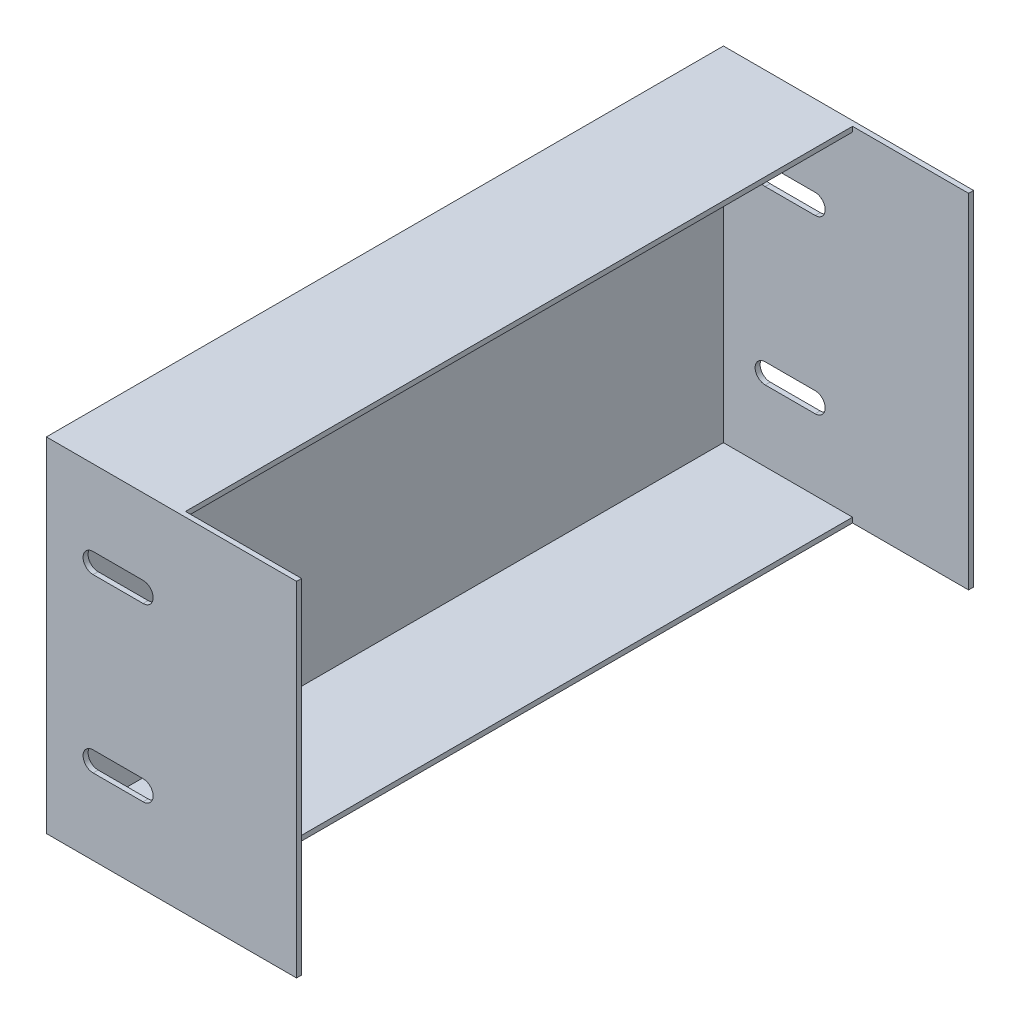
ISO-10303-21;
HEADER;
FILE_DESCRIPTION(('STEP AP214'),'2;1');
FILE_NAME('part.step','',(''),(''),'','','');
FILE_SCHEMA(('AUTOMOTIVE_DESIGN { 1 0 10303 214 1 1 1 1 }'));
ENDSEC;
DATA;
#1=APPLICATION_CONTEXT('core data for automotive mechanical design processes');
#2=APPLICATION_PROTOCOL_DEFINITION('international standard','automotive_design',2000,#1);
#3=PRODUCT_CONTEXT('',#1,'mechanical');
#4=PRODUCT('Part','Part','',(#3));
#5=PRODUCT_RELATED_PRODUCT_CATEGORY('part','',(#4));
#6=PRODUCT_DEFINITION_FORMATION('','',#4);
#7=PRODUCT_DEFINITION_CONTEXT('part definition',#1,'design');
#8=PRODUCT_DEFINITION('design','',#6,#7);
#9=PRODUCT_DEFINITION_SHAPE('','',#8);
#10=(LENGTH_UNIT() NAMED_UNIT(*) SI_UNIT(.MILLI.,.METRE.));
#11=(NAMED_UNIT(*) PLANE_ANGLE_UNIT() SI_UNIT($,.RADIAN.));
#12=(NAMED_UNIT(*) SI_UNIT($,.STERADIAN.) SOLID_ANGLE_UNIT());
#13=UNCERTAINTY_MEASURE_WITH_UNIT(LENGTH_MEASURE(1.E-05),#10,'distance_accuracy_value','');
#14=(GEOMETRIC_REPRESENTATION_CONTEXT(3) GLOBAL_UNCERTAINTY_ASSIGNED_CONTEXT((#13)) GLOBAL_UNIT_ASSIGNED_CONTEXT((#10,
#11,#12)) REPRESENTATION_CONTEXT('',''));
#15=CARTESIAN_POINT('',(0.,0.,0.));
#16=DIRECTION('',(0.,0.,1.));
#17=DIRECTION('',(1.,0.,0.));
#18=AXIS2_PLACEMENT_3D('',#15,#16,#17);
#19=CARTESIAN_POINT('',(75.,0.,0.));
#20=DIRECTION('',(1.,0.,0.));
#21=DIRECTION('',(0.,0.,-1.));
#22=AXIS2_PLACEMENT_3D('',#19,#20,#21);
#23=PLANE('',#22);
#24=DIRECTION('',(0.,1.,0.));
#25=VECTOR('',#24,1.);
#26=CARTESIAN_POINT('',(75.,-50.,-100.));
#27=LINE('',#26,#25);
#28=CARTESIAN_POINT('',(75.,-51.5,-100.));
#29=VERTEX_POINT('',#28);
#30=CARTESIAN_POINT('',(75.,51.5,-100.));
#31=VERTEX_POINT('',#30);
#32=EDGE_CURVE('E241',#29,#31,#27,.T.);
#33=ORIENTED_EDGE('',*,*,#32,.F.);
#34=DIRECTION('',(0.,0.,-1.));
#35=VECTOR('',#34,1.);
#36=CARTESIAN_POINT('',(75.,-51.5,-100.));
#37=LINE('',#36,#35);
#38=CARTESIAN_POINT('',(75.,-51.5,-101.5));
#39=VERTEX_POINT('',#38);
#40=EDGE_CURVE('E245',#29,#39,#37,.T.);
#41=ORIENTED_EDGE('',*,*,#40,.T.);
#42=DIRECTION('',(0.,1.,0.));
#43=VECTOR('',#42,1.);
#44=CARTESIAN_POINT('',(75.,-50.,-101.5));
#45=LINE('',#44,#43);
#46=CARTESIAN_POINT('',(75.,51.5,-101.5));
#47=VERTEX_POINT('',#46);
#48=EDGE_CURVE('E287',#39,#47,#45,.T.);
#49=ORIENTED_EDGE('',*,*,#48,.T.);
#50=DIRECTION('',(0.,0.,1.));
#51=VECTOR('',#50,1.);
#52=CARTESIAN_POINT('',(75.,51.5,-100.));
#53=LINE('',#52,#51);
#54=EDGE_CURVE('E247',#47,#31,#53,.T.);
#55=ORIENTED_EDGE('',*,*,#54,.T.);
#56=EDGE_LOOP('',(#33,#41,#49,#55));
#57=FACE_BOUND('',#56,.T.);
#58=ADVANCED_FACE('F56',(#57),#23,.T.);
#59=CARTESIAN_POINT('',(75.,-50.,-100.));
#60=DIRECTION('',(0.,0.,1.));
#61=DIRECTION('',(1.,0.,0.));
#62=AXIS2_PLACEMENT_3D('',#59,#60,#61);
#63=PLANE('',#62);
#64=DIRECTION('',(-1.,0.,0.));
#65=VECTOR('',#64,1.);
#66=CARTESIAN_POINT('',(75.,-50.,-100.));
#67=LINE('',#66,#65);
#68=CARTESIAN_POINT('',(40.2005511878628,-50.,-100.));
#69=VERTEX_POINT('',#68);
#70=CARTESIAN_POINT('',(1.5,-50.,-100.));
#71=VERTEX_POINT('',#70);
#72=EDGE_CURVE('E320',#69,#71,#67,.T.);
#73=ORIENTED_EDGE('',*,*,#72,.F.);
#74=DIRECTION('',(0.,-1.,0.));
#75=VECTOR('',#74,1.);
#76=CARTESIAN_POINT('',(40.2005511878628,51.5,-100.));
#77=LINE('',#76,#75);
#78=CARTESIAN_POINT('',(40.2005511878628,-51.5,-100.));
#79=VERTEX_POINT('',#78);
#80=EDGE_CURVE('E258',#69,#79,#77,.T.);
#81=ORIENTED_EDGE('',*,*,#80,.T.);
#82=DIRECTION('',(1.,0.,0.));
#83=VECTOR('',#82,1.);
#84=CARTESIAN_POINT('',(75.,-51.5,-100.));
#85=LINE('',#84,#83);
#86=EDGE_CURVE('E254',#79,#29,#85,.T.);
#87=ORIENTED_EDGE('',*,*,#86,.T.);
#88=ORIENTED_EDGE('',*,*,#32,.T.);
#89=DIRECTION('',(1.,0.,0.));
#90=VECTOR('',#89,1.);
#91=CARTESIAN_POINT('',(75.,51.5,-100.));
#92=LINE('',#91,#90);
#93=CARTESIAN_POINT('',(40.2005511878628,51.5,-100.));
#94=VERTEX_POINT('',#93);
#95=EDGE_CURVE('E455',#94,#31,#92,.T.);
#96=ORIENTED_EDGE('',*,*,#95,.F.);
#97=CARTESIAN_POINT('',(40.2005511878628,50.,-100.));
#98=VERTEX_POINT('',#97);
#99=EDGE_CURVE('E447',#94,#98,#77,.T.);
#100=ORIENTED_EDGE('',*,*,#99,.T.);
#101=DIRECTION('',(-1.,0.,0.));
#102=VECTOR('',#101,1.);
#103=CARTESIAN_POINT('',(75.,50.,-100.));
#104=LINE('',#103,#102);
#105=CARTESIAN_POINT('',(1.5,50.,-100.));
#106=VERTEX_POINT('',#105);
#107=EDGE_CURVE('E279',#98,#106,#104,.T.);
#108=ORIENTED_EDGE('',*,*,#107,.T.);
#109=DIRECTION('',(0.,-1.,0.));
#110=VECTOR('',#109,1.);
#111=CARTESIAN_POINT('',(1.5,-50.,-100.));
#112=LINE('',#111,#110);
#113=EDGE_CURVE('E251',#106,#71,#112,.T.);
#114=ORIENTED_EDGE('',*,*,#113,.T.);
#115=EDGE_LOOP('',(#73,#81,#87,#88,#96,#100,#108,#114));
#116=FACE_BOUND('',#115,.T.);
#117=CARTESIAN_POINT('',(14.,-25.75,-100.));
#118=DIRECTION('',(0.,0.,1.));
#119=DIRECTION('',(1.,0.,0.));
#120=AXIS2_PLACEMENT_3D('',#117,#118,#119);
#121=CIRCLE('',#120,3.);
#122=CARTESIAN_POINT('',(14.,-22.75,-100.));
#123=VERTEX_POINT('',#122);
#124=CARTESIAN_POINT('',(14.,-28.75,-100.));
#125=VERTEX_POINT('',#124);
#126=EDGE_CURVE('E387',#123,#125,#121,.T.);
#127=ORIENTED_EDGE('',*,*,#126,.F.);
#128=DIRECTION('',(-1.,0.,0.));
#129=VECTOR('',#128,1.);
#130=CARTESIAN_POINT('',(75.,-22.75,-100.));
#131=LINE('',#130,#129);
#132=CARTESIAN_POINT('',(29.,-22.75,-100.));
#133=VERTEX_POINT('',#132);
#134=EDGE_CURVE('E392',#133,#123,#131,.T.);
#135=ORIENTED_EDGE('',*,*,#134,.F.);
#136=CARTESIAN_POINT('',(29.,-25.75,-100.));
#137=DIRECTION('',(0.,0.,1.));
#138=DIRECTION('',(1.,0.,0.));
#139=AXIS2_PLACEMENT_3D('',#136,#137,#138);
#140=CIRCLE('',#139,3.);
#141=CARTESIAN_POINT('',(29.,-28.75,-100.));
#142=VERTEX_POINT('',#141);
#143=EDGE_CURVE('E396',#142,#133,#140,.T.);
#144=ORIENTED_EDGE('',*,*,#143,.F.);
#145=DIRECTION('',(1.,0.,0.));
#146=VECTOR('',#145,1.);
#147=CARTESIAN_POINT('',(75.,-28.75,-100.));
#148=LINE('',#147,#146);
#149=EDGE_CURVE('E401',#125,#142,#148,.T.);
#150=ORIENTED_EDGE('',*,*,#149,.F.);
#151=EDGE_LOOP('',(#127,#135,#144,#150));
#152=FACE_BOUND('',#151,.T.);
#153=CARTESIAN_POINT('',(14.,25.75,-100.));
#154=DIRECTION('',(0.,0.,1.));
#155=DIRECTION('',(1.,0.,0.));
#156=AXIS2_PLACEMENT_3D('',#153,#154,#155);
#157=CIRCLE('',#156,3.);
#158=CARTESIAN_POINT('',(14.,28.75,-100.));
#159=VERTEX_POINT('',#158);
#160=CARTESIAN_POINT('',(14.,22.75,-100.));
#161=VERTEX_POINT('',#160);
#162=EDGE_CURVE('E331',#159,#161,#157,.T.);
#163=ORIENTED_EDGE('',*,*,#162,.F.);
#164=DIRECTION('',(-1.,0.,0.));
#165=VECTOR('',#164,1.);
#166=CARTESIAN_POINT('',(75.,28.75,-100.));
#167=LINE('',#166,#165);
#168=CARTESIAN_POINT('',(29.,28.75,-100.));
#169=VERTEX_POINT('',#168);
#170=EDGE_CURVE('E336',#169,#159,#167,.T.);
#171=ORIENTED_EDGE('',*,*,#170,.F.);
#172=CARTESIAN_POINT('',(29.,25.75,-100.));
#173=DIRECTION('',(0.,0.,1.));
#174=DIRECTION('',(1.,0.,0.));
#175=AXIS2_PLACEMENT_3D('',#172,#173,#174);
#176=CIRCLE('',#175,3.);
#177=CARTESIAN_POINT('',(29.,22.75,-100.));
#178=VERTEX_POINT('',#177);
#179=EDGE_CURVE('E340',#178,#169,#176,.T.);
#180=ORIENTED_EDGE('',*,*,#179,.F.);
#181=DIRECTION('',(1.,0.,0.));
#182=VECTOR('',#181,1.);
#183=CARTESIAN_POINT('',(75.,22.75,-100.));
#184=LINE('',#183,#182);
#185=EDGE_CURVE('E345',#161,#178,#184,.T.);
#186=ORIENTED_EDGE('',*,*,#185,.F.);
#187=EDGE_LOOP('',(#163,#171,#180,#186));
#188=FACE_BOUND('',#187,.T.);
#189=ADVANCED_FACE('F256',(#116,#152,#188),#63,.T.);
#190=CARTESIAN_POINT('',(75.,50.,-100.));
#191=DIRECTION('',(0.,-1.,0.));
#192=DIRECTION('',(0.,0.,-1.));
#193=AXIS2_PLACEMENT_3D('',#190,#191,#192);
#194=PLANE('',#193);
#195=DIRECTION('',(0.,0.,-1.));
#196=VECTOR('',#195,1.);
#197=CARTESIAN_POINT('',(40.2005511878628,50.,-100.));
#198=LINE('',#197,#196);
#199=CARTESIAN_POINT('',(40.2005511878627,50.,100.));
#200=VERTEX_POINT('',#199);
#201=EDGE_CURVE('E443',#200,#98,#198,.T.);
#202=ORIENTED_EDGE('',*,*,#201,.F.);
#203=DIRECTION('',(-1.,0.,0.));
#204=VECTOR('',#203,1.);
#205=CARTESIAN_POINT('',(75.,50.,100.));
#206=LINE('',#205,#204);
#207=CARTESIAN_POINT('',(1.5,50.,100.));
#208=VERTEX_POINT('',#207);
#209=EDGE_CURVE('E316',#200,#208,#206,.T.);
#210=ORIENTED_EDGE('',*,*,#209,.T.);
#211=DIRECTION('',(0.,0.,-1.));
#212=VECTOR('',#211,1.);
#213=CARTESIAN_POINT('',(1.5,50.,-100.));
#214=LINE('',#213,#212);
#215=EDGE_CURVE('E325',#208,#106,#214,.T.);
#216=ORIENTED_EDGE('',*,*,#215,.T.);
#217=ORIENTED_EDGE('',*,*,#107,.F.);
#218=EDGE_LOOP('',(#202,#210,#216,#217));
#219=FACE_BOUND('',#218,.T.);
#220=ADVANCED_FACE('F478',(#219),#194,.T.);
#221=CARTESIAN_POINT('',(75.,-50.,100.));
#222=DIRECTION('',(0.,0.,-1.));
#223=DIRECTION('',(-1.,0.,0.));
#224=AXIS2_PLACEMENT_3D('',#221,#222,#223);
#225=PLANE('',#224);
#226=ORIENTED_EDGE('',*,*,#209,.F.);
#227=DIRECTION('',(0.,-1.,0.));
#228=VECTOR('',#227,1.);
#229=CARTESIAN_POINT('',(40.2005511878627,51.5,100.));
#230=LINE('',#229,#228);
#231=CARTESIAN_POINT('',(40.2005511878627,51.5,100.));
#232=VERTEX_POINT('',#231);
#233=EDGE_CURVE('E448',#232,#200,#230,.T.);
#234=ORIENTED_EDGE('',*,*,#233,.F.);
#235=DIRECTION('',(-1.,0.,0.));
#236=VECTOR('',#235,1.);
#237=CARTESIAN_POINT('',(75.,51.5,100.));
#238=LINE('',#237,#236);
#239=CARTESIAN_POINT('',(75.,51.5,100.));
#240=VERTEX_POINT('',#239);
#241=EDGE_CURVE('E311',#240,#232,#238,.T.);
#242=ORIENTED_EDGE('',*,*,#241,.F.);
#243=DIRECTION('',(0.,-1.,0.));
#244=VECTOR('',#243,1.);
#245=CARTESIAN_POINT('',(75.,-50.,100.));
#246=LINE('',#245,#244);
#247=CARTESIAN_POINT('',(75.,-51.5,100.));
#248=VERTEX_POINT('',#247);
#249=EDGE_CURVE('E79',#240,#248,#246,.T.);
#250=ORIENTED_EDGE('',*,*,#249,.T.);
#251=DIRECTION('',(-1.,0.,0.));
#252=VECTOR('',#251,1.);
#253=CARTESIAN_POINT('',(75.,-51.5,100.));
#254=LINE('',#253,#252);
#255=CARTESIAN_POINT('',(40.2005511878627,-51.5,100.));
#256=VERTEX_POINT('',#255);
#257=EDGE_CURVE('E262',#248,#256,#254,.T.);
#258=ORIENTED_EDGE('',*,*,#257,.T.);
#259=CARTESIAN_POINT('',(40.2005511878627,-50.,100.));
#260=VERTEX_POINT('',#259);
#261=EDGE_CURVE('E450',#260,#256,#230,.T.);
#262=ORIENTED_EDGE('',*,*,#261,.F.);
#263=DIRECTION('',(-1.,0.,0.));
#264=VECTOR('',#263,1.);
#265=CARTESIAN_POINT('',(75.,-50.,100.));
#266=LINE('',#265,#264);
#267=CARTESIAN_POINT('',(1.5,-50.,100.));
#268=VERTEX_POINT('',#267);
#269=EDGE_CURVE('E318',#260,#268,#266,.T.);
#270=ORIENTED_EDGE('',*,*,#269,.T.);
#271=DIRECTION('',(0.,1.,0.));
#272=VECTOR('',#271,1.);
#273=CARTESIAN_POINT('',(1.5,-50.,100.));
#274=LINE('',#273,#272);
#275=EDGE_CURVE('E328',#268,#208,#274,.T.);
#276=ORIENTED_EDGE('',*,*,#275,.T.);
#277=EDGE_LOOP('',(#226,#234,#242,#250,#258,#262,#270,#276));
#278=FACE_BOUND('',#277,.T.);
#279=CARTESIAN_POINT('',(14.,-25.75,100.));
#280=DIRECTION('',(0.,0.,-1.));
#281=DIRECTION('',(-1.,0.,0.));
#282=AXIS2_PLACEMENT_3D('',#279,#280,#281);
#283=CIRCLE('',#282,3.);
#284=CARTESIAN_POINT('',(14.,-28.75,99.9999999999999));
#285=VERTEX_POINT('',#284);
#286=CARTESIAN_POINT('',(14.,-22.75,99.9999999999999));
#287=VERTEX_POINT('',#286);
#288=EDGE_CURVE('E390',#285,#287,#283,.T.);
#289=ORIENTED_EDGE('',*,*,#288,.F.);
#290=DIRECTION('',(-1.,0.,0.));
#291=VECTOR('',#290,1.);
#292=CARTESIAN_POINT('',(75.,-28.75,100.));
#293=LINE('',#292,#291);
#294=CARTESIAN_POINT('',(29.,-28.75,100.));
#295=VERTEX_POINT('',#294);
#296=EDGE_CURVE('E403',#295,#285,#293,.T.);
#297=ORIENTED_EDGE('',*,*,#296,.F.);
#298=CARTESIAN_POINT('',(29.,-25.75,100.));
#299=DIRECTION('',(0.,0.,-1.));
#300=DIRECTION('',(-1.,0.,0.));
#301=AXIS2_PLACEMENT_3D('',#298,#299,#300);
#302=CIRCLE('',#301,3.);
#303=CARTESIAN_POINT('',(29.,-22.75,99.9999999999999));
#304=VERTEX_POINT('',#303);
#305=EDGE_CURVE('E398',#304,#295,#302,.T.);
#306=ORIENTED_EDGE('',*,*,#305,.F.);
#307=DIRECTION('',(1.,0.,0.));
#308=VECTOR('',#307,1.);
#309=CARTESIAN_POINT('',(75.,-22.75,100.));
#310=LINE('',#309,#308);
#311=EDGE_CURVE('E394',#287,#304,#310,.T.);
#312=ORIENTED_EDGE('',*,*,#311,.F.);
#313=EDGE_LOOP('',(#289,#297,#306,#312));
#314=FACE_BOUND('',#313,.T.);
#315=CARTESIAN_POINT('',(14.,25.75,100.));
#316=DIRECTION('',(0.,0.,-1.));
#317=DIRECTION('',(-1.,0.,0.));
#318=AXIS2_PLACEMENT_3D('',#315,#316,#317);
#319=CIRCLE('',#318,3.);
#320=CARTESIAN_POINT('',(14.,22.75,99.9999999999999));
#321=VERTEX_POINT('',#320);
#322=CARTESIAN_POINT('',(14.,28.75,99.9999999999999));
#323=VERTEX_POINT('',#322);
#324=EDGE_CURVE('E334',#321,#323,#319,.T.);
#325=ORIENTED_EDGE('',*,*,#324,.F.);
#326=DIRECTION('',(-1.,0.,0.));
#327=VECTOR('',#326,1.);
#328=CARTESIAN_POINT('',(75.,22.75,100.));
#329=LINE('',#328,#327);
#330=CARTESIAN_POINT('',(29.,22.75,100.));
#331=VERTEX_POINT('',#330);
#332=EDGE_CURVE('E347',#331,#321,#329,.T.);
#333=ORIENTED_EDGE('',*,*,#332,.F.);
#334=CARTESIAN_POINT('',(29.,25.75,100.));
#335=DIRECTION('',(0.,0.,-1.));
#336=DIRECTION('',(-1.,0.,0.));
#337=AXIS2_PLACEMENT_3D('',#334,#335,#336);
#338=CIRCLE('',#337,3.);
#339=CARTESIAN_POINT('',(29.,28.75,99.9999999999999));
#340=VERTEX_POINT('',#339);
#341=EDGE_CURVE('E342',#340,#331,#338,.T.);
#342=ORIENTED_EDGE('',*,*,#341,.F.);
#343=DIRECTION('',(1.,0.,0.));
#344=VECTOR('',#343,1.);
#345=CARTESIAN_POINT('',(75.,28.75,100.));
#346=LINE('',#345,#344);
#347=EDGE_CURVE('E338',#323,#340,#346,.T.);
#348=ORIENTED_EDGE('',*,*,#347,.F.);
#349=EDGE_LOOP('',(#325,#333,#342,#348));
#350=FACE_BOUND('',#349,.T.);
#351=ADVANCED_FACE('F461',(#278,#314,#350),#225,.T.);
#352=CARTESIAN_POINT('',(75.,-50.,-100.));
#353=DIRECTION('',(0.,1.,0.));
#354=DIRECTION('',(0.,0.,1.));
#355=AXIS2_PLACEMENT_3D('',#352,#353,#354);
#356=PLANE('',#355);
#357=DIRECTION('',(0.,0.,1.));
#358=VECTOR('',#357,1.);
#359=CARTESIAN_POINT('',(40.2005511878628,-50.,-100.));
#360=LINE('',#359,#358);
#361=EDGE_CURVE('E445',#69,#260,#360,.T.);
#362=ORIENTED_EDGE('',*,*,#361,.F.);
#363=ORIENTED_EDGE('',*,*,#72,.T.);
#364=DIRECTION('',(0.,0.,1.));
#365=VECTOR('',#364,1.);
#366=CARTESIAN_POINT('',(1.5,-50.,-100.));
#367=LINE('',#366,#365);
#368=EDGE_CURVE('E12',#71,#268,#367,.T.);
#369=ORIENTED_EDGE('',*,*,#368,.T.);
#370=ORIENTED_EDGE('',*,*,#269,.F.);
#371=EDGE_LOOP('',(#362,#363,#369,#370));
#372=FACE_BOUND('',#371,.T.);
#373=ADVANCED_FACE('F468',(#372),#356,.T.);
#374=ORIENTED_EDGE('',*,*,#249,.F.);
#375=CARTESIAN_POINT('',(75.,51.5,101.5));
#376=VERTEX_POINT('',#375);
#377=EDGE_CURVE('E310',#240,#376,#53,.T.);
#378=ORIENTED_EDGE('',*,*,#377,.T.);
#379=DIRECTION('',(0.,-1.,0.));
#380=VECTOR('',#379,1.);
#381=CARTESIAN_POINT('',(75.,-50.,101.5));
#382=LINE('',#381,#380);
#383=CARTESIAN_POINT('',(75.,-51.5,101.5));
#384=VERTEX_POINT('',#383);
#385=EDGE_CURVE('E269',#376,#384,#382,.T.);
#386=ORIENTED_EDGE('',*,*,#385,.T.);
#387=EDGE_CURVE('E268',#384,#248,#37,.T.);
#388=ORIENTED_EDGE('',*,*,#387,.T.);
#389=EDGE_LOOP('',(#374,#378,#386,#388));
#390=FACE_BOUND('',#389,.T.);
#391=ADVANCED_FACE('F489',(#390),#23,.T.);
#392=CARTESIAN_POINT('',(0.,0.,0.));
#393=DIRECTION('',(1.,0.,0.));
#394=DIRECTION('',(0.,0.,-1.));
#395=AXIS2_PLACEMENT_3D('',#392,#393,#394);
#396=PLANE('',#395);
#397=DIRECTION('',(0.,1.,0.));
#398=VECTOR('',#397,1.);
#399=CARTESIAN_POINT('',(0.,-50.,-101.5));
#400=LINE('',#399,#398);
#401=CARTESIAN_POINT('',(0.,-51.5,-101.5));
#402=VERTEX_POINT('',#401);
#403=CARTESIAN_POINT('',(0.,51.5,-101.5));
#404=VERTEX_POINT('',#403);
#405=EDGE_CURVE('E275',#402,#404,#400,.T.);
#406=ORIENTED_EDGE('',*,*,#405,.F.);
#407=DIRECTION('',(0.,0.,-1.));
#408=VECTOR('',#407,1.);
#409=CARTESIAN_POINT('',(0.,-51.5,-100.));
#410=LINE('',#409,#408);
#411=CARTESIAN_POINT('',(0.,-51.5,101.5));
#412=VERTEX_POINT('',#411);
#413=EDGE_CURVE('E285',#412,#402,#410,.T.);
#414=ORIENTED_EDGE('',*,*,#413,.F.);
#415=DIRECTION('',(0.,-1.,0.));
#416=VECTOR('',#415,1.);
#417=CARTESIAN_POINT('',(0.,-50.,101.5));
#418=LINE('',#417,#416);
#419=CARTESIAN_POINT('',(0.,51.5,101.5));
#420=VERTEX_POINT('',#419);
#421=EDGE_CURVE('E282',#420,#412,#418,.T.);
#422=ORIENTED_EDGE('',*,*,#421,.F.);
#423=DIRECTION('',(0.,0.,1.));
#424=VECTOR('',#423,1.);
#425=CARTESIAN_POINT('',(0.,51.5,-100.));
#426=LINE('',#425,#424);
#427=EDGE_CURVE('E278',#404,#420,#426,.T.);
#428=ORIENTED_EDGE('',*,*,#427,.F.);
#429=EDGE_LOOP('',(#406,#414,#422,#428));
#430=FACE_BOUND('',#429,.T.);
#431=ADVANCED_FACE('F301',(#430),#396,.F.);
#432=CARTESIAN_POINT('',(75.,-50.,-101.5));
#433=DIRECTION('',(0.,0.,1.));
#434=DIRECTION('',(1.,0.,0.));
#435=AXIS2_PLACEMENT_3D('',#432,#433,#434);
#436=PLANE('',#435);
#437=DIRECTION('',(-1.,0.,0.));
#438=VECTOR('',#437,1.);
#439=CARTESIAN_POINT('',(14.,-22.75,-101.5));
#440=LINE('',#439,#438);
#441=CARTESIAN_POINT('',(29.,-22.75,-101.5));
#442=VERTEX_POINT('',#441);
#443=CARTESIAN_POINT('',(14.,-22.75,-101.5));
#444=VERTEX_POINT('',#443);
#445=EDGE_CURVE('E420',#442,#444,#440,.T.);
#446=ORIENTED_EDGE('',*,*,#445,.T.);
#447=CARTESIAN_POINT('',(14.,-25.75,-101.5));
#448=DIRECTION('',(0.,0.,1.));
#449=DIRECTION('',(1.,0.,0.));
#450=AXIS2_PLACEMENT_3D('',#447,#448,#449);
#451=CIRCLE('',#450,3.);
#452=CARTESIAN_POINT('',(14.,-28.75,-101.5));
#453=VERTEX_POINT('',#452);
#454=EDGE_CURVE('E429',#444,#453,#451,.T.);
#455=ORIENTED_EDGE('',*,*,#454,.T.);
#456=DIRECTION('',(1.,0.,0.));
#457=VECTOR('',#456,1.);
#458=CARTESIAN_POINT('',(14.,-28.75,-101.5));
#459=LINE('',#458,#457);
#460=CARTESIAN_POINT('',(29.,-28.75,-101.5));
#461=VERTEX_POINT('',#460);
#462=EDGE_CURVE('E426',#453,#461,#459,.T.);
#463=ORIENTED_EDGE('',*,*,#462,.T.);
#464=CARTESIAN_POINT('',(29.,-25.75,-101.5));
#465=DIRECTION('',(0.,0.,1.));
#466=DIRECTION('',(1.,0.,0.));
#467=AXIS2_PLACEMENT_3D('',#464,#465,#466);
#468=CIRCLE('',#467,3.);
#469=EDGE_CURVE('E423',#461,#442,#468,.T.);
#470=ORIENTED_EDGE('',*,*,#469,.T.);
#471=EDGE_LOOP('',(#446,#455,#463,#470));
#472=FACE_BOUND('',#471,.T.);
#473=DIRECTION('',(-1.,0.,0.));
#474=VECTOR('',#473,1.);
#475=CARTESIAN_POINT('',(14.,28.75,-101.5));
#476=LINE('',#475,#474);
#477=CARTESIAN_POINT('',(29.,28.75,-101.5));
#478=VERTEX_POINT('',#477);
#479=CARTESIAN_POINT('',(14.,28.75,-101.5));
#480=VERTEX_POINT('',#479);
#481=EDGE_CURVE('E364',#478,#480,#476,.T.);
#482=ORIENTED_EDGE('',*,*,#481,.T.);
#483=CARTESIAN_POINT('',(14.,25.75,-101.5));
#484=DIRECTION('',(0.,0.,1.));
#485=DIRECTION('',(1.,0.,0.));
#486=AXIS2_PLACEMENT_3D('',#483,#484,#485);
#487=CIRCLE('',#486,3.);
#488=CARTESIAN_POINT('',(14.,22.75,-101.5));
#489=VERTEX_POINT('',#488);
#490=EDGE_CURVE('E373',#480,#489,#487,.T.);
#491=ORIENTED_EDGE('',*,*,#490,.T.);
#492=DIRECTION('',(1.,0.,0.));
#493=VECTOR('',#492,1.);
#494=CARTESIAN_POINT('',(14.,22.75,-101.5));
#495=LINE('',#494,#493);
#496=CARTESIAN_POINT('',(29.,22.75,-101.5));
#497=VERTEX_POINT('',#496);
#498=EDGE_CURVE('E370',#489,#497,#495,.T.);
#499=ORIENTED_EDGE('',*,*,#498,.T.);
#500=CARTESIAN_POINT('',(29.,25.75,-101.5));
#501=DIRECTION('',(0.,0.,1.));
#502=DIRECTION('',(1.,0.,0.));
#503=AXIS2_PLACEMENT_3D('',#500,#501,#502);
#504=CIRCLE('',#503,3.);
#505=EDGE_CURVE('E367',#497,#478,#504,.T.);
#506=ORIENTED_EDGE('',*,*,#505,.T.);
#507=EDGE_LOOP('',(#482,#491,#499,#506));
#508=FACE_BOUND('',#507,.T.);
#509=ORIENTED_EDGE('',*,*,#405,.T.);
#510=DIRECTION('',(-1.,0.,0.));
#511=VECTOR('',#510,1.);
#512=CARTESIAN_POINT('',(75.,51.5,-101.5));
#513=LINE('',#512,#511);
#514=EDGE_CURVE('E64',#47,#404,#513,.T.);
#515=ORIENTED_EDGE('',*,*,#514,.F.);
#516=ORIENTED_EDGE('',*,*,#48,.F.);
#517=DIRECTION('',(-1.,0.,0.));
#518=VECTOR('',#517,1.);
#519=CARTESIAN_POINT('',(75.,-51.5,-101.5));
#520=LINE('',#519,#518);
#521=EDGE_CURVE('E266',#39,#402,#520,.T.);
#522=ORIENTED_EDGE('',*,*,#521,.T.);
#523=EDGE_LOOP('',(#509,#515,#516,#522));
#524=FACE_BOUND('',#523,.T.);
#525=ADVANCED_FACE('F58',(#472,#508,#524),#436,.F.);
#526=CARTESIAN_POINT('',(75.,51.5,-100.));
#527=DIRECTION('',(0.,-1.,0.));
#528=DIRECTION('',(0.,0.,-1.));
#529=AXIS2_PLACEMENT_3D('',#526,#527,#528);
#530=PLANE('',#529);
#531=DIRECTION('',(0.,0.,-1.));
#532=VECTOR('',#531,1.);
#533=CARTESIAN_POINT('',(40.2005511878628,51.5,-100.));
#534=LINE('',#533,#532);
#535=EDGE_CURVE('E71',#232,#94,#534,.T.);
#536=ORIENTED_EDGE('',*,*,#535,.T.);
#537=ORIENTED_EDGE('',*,*,#95,.T.);
#538=ORIENTED_EDGE('',*,*,#54,.F.);
#539=ORIENTED_EDGE('',*,*,#514,.T.);
#540=ORIENTED_EDGE('',*,*,#427,.T.);
#541=DIRECTION('',(-1.,0.,0.));
#542=VECTOR('',#541,1.);
#543=CARTESIAN_POINT('',(75.,51.5,101.5));
#544=LINE('',#543,#542);
#545=EDGE_CURVE('E291',#376,#420,#544,.T.);
#546=ORIENTED_EDGE('',*,*,#545,.F.);
#547=ORIENTED_EDGE('',*,*,#377,.F.);
#548=ORIENTED_EDGE('',*,*,#241,.T.);
#549=EDGE_LOOP('',(#536,#537,#538,#539,#540,#546,#547,#548));
#550=FACE_BOUND('',#549,.T.);
#551=ADVANCED_FACE('F295',(#550),#530,.F.);
#552=CARTESIAN_POINT('',(75.,-50.,101.5));
#553=DIRECTION('',(0.,0.,-1.));
#554=DIRECTION('',(-1.,0.,0.));
#555=AXIS2_PLACEMENT_3D('',#552,#553,#554);
#556=PLANE('',#555);
#557=DIRECTION('',(1.,0.,0.));
#558=VECTOR('',#557,1.);
#559=CARTESIAN_POINT('',(14.,-28.75,101.5));
#560=LINE('',#559,#558);
#561=CARTESIAN_POINT('',(14.,-28.75,101.5));
#562=VERTEX_POINT('',#561);
#563=CARTESIAN_POINT('',(29.,-28.75,101.5));
#564=VERTEX_POINT('',#563);
#565=EDGE_CURVE('E438',#562,#564,#560,.T.);
#566=ORIENTED_EDGE('',*,*,#565,.F.);
#567=CARTESIAN_POINT('',(14.,-25.75,101.5));
#568=DIRECTION('',(0.,0.,1.));
#569=DIRECTION('',(1.,0.,0.));
#570=AXIS2_PLACEMENT_3D('',#567,#568,#569);
#571=CIRCLE('',#570,3.);
#572=CARTESIAN_POINT('',(14.,-22.75,101.5));
#573=VERTEX_POINT('',#572);
#574=EDGE_CURVE('E441',#573,#562,#571,.T.);
#575=ORIENTED_EDGE('',*,*,#574,.F.);
#576=DIRECTION('',(-1.,0.,0.));
#577=VECTOR('',#576,1.);
#578=CARTESIAN_POINT('',(14.,-22.75,101.5));
#579=LINE('',#578,#577);
#580=CARTESIAN_POINT('',(29.,-22.75,101.5));
#581=VERTEX_POINT('',#580);
#582=EDGE_CURVE('E432',#581,#573,#579,.T.);
#583=ORIENTED_EDGE('',*,*,#582,.F.);
#584=CARTESIAN_POINT('',(29.,-25.75,101.5));
#585=DIRECTION('',(0.,0.,1.));
#586=DIRECTION('',(1.,0.,0.));
#587=AXIS2_PLACEMENT_3D('',#584,#585,#586);
#588=CIRCLE('',#587,3.);
#589=EDGE_CURVE('E435',#564,#581,#588,.T.);
#590=ORIENTED_EDGE('',*,*,#589,.F.);
#591=EDGE_LOOP('',(#566,#575,#583,#590));
#592=FACE_BOUND('',#591,.T.);
#593=DIRECTION('',(1.,0.,0.));
#594=VECTOR('',#593,1.);
#595=CARTESIAN_POINT('',(14.,22.75,101.5));
#596=LINE('',#595,#594);
#597=CARTESIAN_POINT('',(14.,22.75,101.5));
#598=VERTEX_POINT('',#597);
#599=CARTESIAN_POINT('',(29.,22.75,101.5));
#600=VERTEX_POINT('',#599);
#601=EDGE_CURVE('E382',#598,#600,#596,.T.);
#602=ORIENTED_EDGE('',*,*,#601,.F.);
#603=CARTESIAN_POINT('',(14.,25.75,101.5));
#604=DIRECTION('',(0.,0.,1.));
#605=DIRECTION('',(1.,0.,0.));
#606=AXIS2_PLACEMENT_3D('',#603,#604,#605);
#607=CIRCLE('',#606,3.);
#608=CARTESIAN_POINT('',(14.,28.75,101.5));
#609=VERTEX_POINT('',#608);
#610=EDGE_CURVE('E385',#609,#598,#607,.T.);
#611=ORIENTED_EDGE('',*,*,#610,.F.);
#612=DIRECTION('',(-1.,0.,0.));
#613=VECTOR('',#612,1.);
#614=CARTESIAN_POINT('',(14.,28.75,101.5));
#615=LINE('',#614,#613);
#616=CARTESIAN_POINT('',(29.,28.75,101.5));
#617=VERTEX_POINT('',#616);
#618=EDGE_CURVE('E376',#617,#609,#615,.T.);
#619=ORIENTED_EDGE('',*,*,#618,.F.);
#620=CARTESIAN_POINT('',(29.,25.75,101.5));
#621=DIRECTION('',(0.,0.,1.));
#622=DIRECTION('',(1.,0.,0.));
#623=AXIS2_PLACEMENT_3D('',#620,#621,#622);
#624=CIRCLE('',#623,3.);
#625=EDGE_CURVE('E379',#600,#617,#624,.T.);
#626=ORIENTED_EDGE('',*,*,#625,.F.);
#627=EDGE_LOOP('',(#602,#611,#619,#626));
#628=FACE_BOUND('',#627,.T.);
#629=ORIENTED_EDGE('',*,*,#421,.T.);
#630=DIRECTION('',(-1.,0.,0.));
#631=VECTOR('',#630,1.);
#632=CARTESIAN_POINT('',(75.,-51.5,101.5));
#633=LINE('',#632,#631);
#634=EDGE_CURVE('E289',#384,#412,#633,.T.);
#635=ORIENTED_EDGE('',*,*,#634,.F.);
#636=ORIENTED_EDGE('',*,*,#385,.F.);
#637=ORIENTED_EDGE('',*,*,#545,.T.);
#638=EDGE_LOOP('',(#629,#635,#636,#637));
#639=FACE_BOUND('',#638,.T.);
#640=ADVANCED_FACE('F307',(#592,#628,#639),#556,.F.);
#641=CARTESIAN_POINT('',(75.,-51.5,-100.));
#642=DIRECTION('',(0.,1.,0.));
#643=DIRECTION('',(0.,0.,1.));
#644=AXIS2_PLACEMENT_3D('',#641,#642,#643);
#645=PLANE('',#644);
#646=ORIENTED_EDGE('',*,*,#40,.F.);
#647=ORIENTED_EDGE('',*,*,#86,.F.);
#648=DIRECTION('',(0.,0.,-1.));
#649=VECTOR('',#648,1.);
#650=CARTESIAN_POINT('',(40.2005511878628,-51.5,-100.));
#651=LINE('',#650,#649);
#652=EDGE_CURVE('E457',#256,#79,#651,.T.);
#653=ORIENTED_EDGE('',*,*,#652,.F.);
#654=ORIENTED_EDGE('',*,*,#257,.F.);
#655=ORIENTED_EDGE('',*,*,#387,.F.);
#656=ORIENTED_EDGE('',*,*,#634,.T.);
#657=ORIENTED_EDGE('',*,*,#413,.T.);
#658=ORIENTED_EDGE('',*,*,#521,.F.);
#659=EDGE_LOOP('',(#646,#647,#653,#654,#655,#656,#657,#658));
#660=FACE_BOUND('',#659,.T.);
#661=ADVANCED_FACE('F264',(#660),#645,.F.);
#662=CARTESIAN_POINT('',(1.5,0.,0.));
#663=DIRECTION('',(-1.,0.,0.));
#664=DIRECTION('',(0.,0.,1.));
#665=AXIS2_PLACEMENT_3D('',#662,#663,#664);
#666=PLANE('',#665);
#667=ORIENTED_EDGE('',*,*,#113,.F.);
#668=ORIENTED_EDGE('',*,*,#215,.F.);
#669=ORIENTED_EDGE('',*,*,#275,.F.);
#670=ORIENTED_EDGE('',*,*,#368,.F.);
#671=EDGE_LOOP('',(#667,#668,#669,#670));
#672=FACE_BOUND('',#671,.T.);
#673=ADVANCED_FACE('F474',(#672),#666,.F.);
#674=CARTESIAN_POINT('',(14.,22.75,-101.5));
#675=DIRECTION('',(0.,-1.,0.));
#676=DIRECTION('',(0.,0.,-1.));
#677=AXIS2_PLACEMENT_3D('',#674,#675,#676);
#678=PLANE('',#677);
#679=ORIENTED_EDGE('',*,*,#332,.T.);
#680=DIRECTION('',(0.,0.,1.));
#681=VECTOR('',#680,1.);
#682=CARTESIAN_POINT('',(14.,22.75,-101.5));
#683=LINE('',#682,#681);
#684=EDGE_CURVE('E353',#321,#598,#683,.T.);
#685=ORIENTED_EDGE('',*,*,#684,.T.);
#686=ORIENTED_EDGE('',*,*,#601,.T.);
#687=DIRECTION('',(0.,0.,1.));
#688=VECTOR('',#687,1.);
#689=CARTESIAN_POINT('',(29.,22.75,-101.5));
#690=LINE('',#689,#688);
#691=EDGE_CURVE('E352',#331,#600,#690,.T.);
#692=ORIENTED_EDGE('',*,*,#691,.F.);
#693=EDGE_LOOP('',(#679,#685,#686,#692));
#694=FACE_BOUND('',#693,.T.);
#695=ADVANCED_FACE('F628',(#694),#678,.F.);
#696=CARTESIAN_POINT('',(29.,25.75,-101.5));
#697=DIRECTION('',(0.,0.,1.));
#698=DIRECTION('',(1.,0.,0.));
#699=AXIS2_PLACEMENT_3D('',#696,#697,#698);
#700=CYLINDRICAL_SURFACE('',#699,3.);
#701=ORIENTED_EDGE('',*,*,#341,.T.);
#702=ORIENTED_EDGE('',*,*,#691,.T.);
#703=ORIENTED_EDGE('',*,*,#625,.T.);
#704=DIRECTION('',(0.,0.,1.));
#705=VECTOR('',#704,1.);
#706=CARTESIAN_POINT('',(29.,28.75,-101.5));
#707=LINE('',#706,#705);
#708=EDGE_CURVE('E357',#340,#617,#707,.T.);
#709=ORIENTED_EDGE('',*,*,#708,.F.);
#710=EDGE_LOOP('',(#701,#702,#703,#709));
#711=FACE_BOUND('',#710,.T.);
#712=ADVANCED_FACE('F637',(#711),#700,.F.);
#713=CARTESIAN_POINT('',(14.,28.75,-101.5));
#714=DIRECTION('',(0.,1.,0.));
#715=DIRECTION('',(0.,0.,1.));
#716=AXIS2_PLACEMENT_3D('',#713,#714,#715);
#717=PLANE('',#716);
#718=ORIENTED_EDGE('',*,*,#347,.T.);
#719=ORIENTED_EDGE('',*,*,#708,.T.);
#720=ORIENTED_EDGE('',*,*,#618,.T.);
#721=DIRECTION('',(0.,0.,1.));
#722=VECTOR('',#721,1.);
#723=CARTESIAN_POINT('',(14.,28.75,-101.5));
#724=LINE('',#723,#722);
#725=EDGE_CURVE('E361',#323,#609,#724,.T.);
#726=ORIENTED_EDGE('',*,*,#725,.F.);
#727=EDGE_LOOP('',(#718,#719,#720,#726));
#728=FACE_BOUND('',#727,.T.);
#729=ADVANCED_FACE('F646',(#728),#717,.F.);
#730=CARTESIAN_POINT('',(14.,25.75,-101.5));
#731=DIRECTION('',(0.,0.,1.));
#732=DIRECTION('',(1.,0.,0.));
#733=AXIS2_PLACEMENT_3D('',#730,#731,#732);
#734=CYLINDRICAL_SURFACE('',#733,3.);
#735=ORIENTED_EDGE('',*,*,#324,.T.);
#736=ORIENTED_EDGE('',*,*,#725,.T.);
#737=ORIENTED_EDGE('',*,*,#610,.T.);
#738=ORIENTED_EDGE('',*,*,#684,.F.);
#739=EDGE_LOOP('',(#735,#736,#737,#738));
#740=FACE_BOUND('',#739,.T.);
#741=ADVANCED_FACE('F652',(#740),#734,.F.);
#742=ORIENTED_EDGE('',*,*,#162,.T.);
#743=EDGE_CURVE('E350',#489,#161,#683,.T.);
#744=ORIENTED_EDGE('',*,*,#743,.F.);
#745=ORIENTED_EDGE('',*,*,#490,.F.);
#746=EDGE_CURVE('E349',#480,#159,#724,.T.);
#747=ORIENTED_EDGE('',*,*,#746,.T.);
#748=EDGE_LOOP('',(#742,#744,#745,#747));
#749=FACE_BOUND('',#748,.T.);
#750=ADVANCED_FACE('F643',(#749),#734,.F.);
#751=ORIENTED_EDGE('',*,*,#170,.T.);
#752=ORIENTED_EDGE('',*,*,#746,.F.);
#753=ORIENTED_EDGE('',*,*,#481,.F.);
#754=EDGE_CURVE('E358',#478,#169,#707,.T.);
#755=ORIENTED_EDGE('',*,*,#754,.T.);
#756=EDGE_LOOP('',(#751,#752,#753,#755));
#757=FACE_BOUND('',#756,.T.);
#758=ADVANCED_FACE('F634',(#757),#717,.F.);
#759=ORIENTED_EDGE('',*,*,#179,.T.);
#760=ORIENTED_EDGE('',*,*,#754,.F.);
#761=ORIENTED_EDGE('',*,*,#505,.F.);
#762=EDGE_CURVE('E354',#497,#178,#690,.T.);
#763=ORIENTED_EDGE('',*,*,#762,.T.);
#764=EDGE_LOOP('',(#759,#760,#761,#763));
#765=FACE_BOUND('',#764,.T.);
#766=ADVANCED_FACE('F625',(#765),#700,.F.);
#767=ORIENTED_EDGE('',*,*,#185,.T.);
#768=ORIENTED_EDGE('',*,*,#762,.F.);
#769=ORIENTED_EDGE('',*,*,#498,.F.);
#770=ORIENTED_EDGE('',*,*,#743,.T.);
#771=EDGE_LOOP('',(#767,#768,#769,#770));
#772=FACE_BOUND('',#771,.T.);
#773=ADVANCED_FACE('F618',(#772),#678,.F.);
#774=CARTESIAN_POINT('',(14.,-28.75,-101.5));
#775=DIRECTION('',(0.,-1.,0.));
#776=DIRECTION('',(0.,0.,-1.));
#777=AXIS2_PLACEMENT_3D('',#774,#775,#776);
#778=PLANE('',#777);
#779=ORIENTED_EDGE('',*,*,#296,.T.);
#780=DIRECTION('',(0.,0.,1.));
#781=VECTOR('',#780,1.);
#782=CARTESIAN_POINT('',(14.,-28.75,-101.5));
#783=LINE('',#782,#781);
#784=EDGE_CURVE('E409',#285,#562,#783,.T.);
#785=ORIENTED_EDGE('',*,*,#784,.T.);
#786=ORIENTED_EDGE('',*,*,#565,.T.);
#787=DIRECTION('',(0.,0.,1.));
#788=VECTOR('',#787,1.);
#789=CARTESIAN_POINT('',(29.,-28.75,-101.5));
#790=LINE('',#789,#788);
#791=EDGE_CURVE('E408',#295,#564,#790,.T.);
#792=ORIENTED_EDGE('',*,*,#791,.F.);
#793=EDGE_LOOP('',(#779,#785,#786,#792));
#794=FACE_BOUND('',#793,.T.);
#795=ADVANCED_FACE('F569',(#794),#778,.F.);
#796=CARTESIAN_POINT('',(29.,-25.75,-101.5));
#797=DIRECTION('',(0.,0.,1.));
#798=DIRECTION('',(1.,0.,0.));
#799=AXIS2_PLACEMENT_3D('',#796,#797,#798);
#800=CYLINDRICAL_SURFACE('',#799,3.);
#801=ORIENTED_EDGE('',*,*,#305,.T.);
#802=ORIENTED_EDGE('',*,*,#791,.T.);
#803=ORIENTED_EDGE('',*,*,#589,.T.);
#804=DIRECTION('',(0.,0.,1.));
#805=VECTOR('',#804,1.);
#806=CARTESIAN_POINT('',(29.,-22.75,-101.5));
#807=LINE('',#806,#805);
#808=EDGE_CURVE('E413',#304,#581,#807,.T.);
#809=ORIENTED_EDGE('',*,*,#808,.F.);
#810=EDGE_LOOP('',(#801,#802,#803,#809));
#811=FACE_BOUND('',#810,.T.);
#812=ADVANCED_FACE('F578',(#811),#800,.F.);
#813=CARTESIAN_POINT('',(14.,-22.75,-101.5));
#814=DIRECTION('',(0.,1.,0.));
#815=DIRECTION('',(0.,0.,1.));
#816=AXIS2_PLACEMENT_3D('',#813,#814,#815);
#817=PLANE('',#816);
#818=ORIENTED_EDGE('',*,*,#311,.T.);
#819=ORIENTED_EDGE('',*,*,#808,.T.);
#820=ORIENTED_EDGE('',*,*,#582,.T.);
#821=DIRECTION('',(0.,0.,1.));
#822=VECTOR('',#821,1.);
#823=CARTESIAN_POINT('',(14.,-22.75,-101.5));
#824=LINE('',#823,#822);
#825=EDGE_CURVE('E417',#287,#573,#824,.T.);
#826=ORIENTED_EDGE('',*,*,#825,.F.);
#827=EDGE_LOOP('',(#818,#819,#820,#826));
#828=FACE_BOUND('',#827,.T.);
#829=ADVANCED_FACE('F586',(#828),#817,.F.);
#830=CARTESIAN_POINT('',(14.,-25.75,-101.5));
#831=DIRECTION('',(0.,0.,1.));
#832=DIRECTION('',(1.,0.,0.));
#833=AXIS2_PLACEMENT_3D('',#830,#831,#832);
#834=CYLINDRICAL_SURFACE('',#833,3.);
#835=ORIENTED_EDGE('',*,*,#288,.T.);
#836=ORIENTED_EDGE('',*,*,#825,.T.);
#837=ORIENTED_EDGE('',*,*,#574,.T.);
#838=ORIENTED_EDGE('',*,*,#784,.F.);
#839=EDGE_LOOP('',(#835,#836,#837,#838));
#840=FACE_BOUND('',#839,.T.);
#841=ADVANCED_FACE('F592',(#840),#834,.F.);
#842=ORIENTED_EDGE('',*,*,#126,.T.);
#843=EDGE_CURVE('E406',#453,#125,#783,.T.);
#844=ORIENTED_EDGE('',*,*,#843,.F.);
#845=ORIENTED_EDGE('',*,*,#454,.F.);
#846=EDGE_CURVE('E405',#444,#123,#824,.T.);
#847=ORIENTED_EDGE('',*,*,#846,.T.);
#848=EDGE_LOOP('',(#842,#844,#845,#847));
#849=FACE_BOUND('',#848,.T.);
#850=ADVANCED_FACE('F584',(#849),#834,.F.);
#851=ORIENTED_EDGE('',*,*,#134,.T.);
#852=ORIENTED_EDGE('',*,*,#846,.F.);
#853=ORIENTED_EDGE('',*,*,#445,.F.);
#854=EDGE_CURVE('E414',#442,#133,#807,.T.);
#855=ORIENTED_EDGE('',*,*,#854,.T.);
#856=EDGE_LOOP('',(#851,#852,#853,#855));
#857=FACE_BOUND('',#856,.T.);
#858=ADVANCED_FACE('F575',(#857),#817,.F.);
#859=ORIENTED_EDGE('',*,*,#143,.T.);
#860=ORIENTED_EDGE('',*,*,#854,.F.);
#861=ORIENTED_EDGE('',*,*,#469,.F.);
#862=EDGE_CURVE('E410',#461,#142,#790,.T.);
#863=ORIENTED_EDGE('',*,*,#862,.T.);
#864=EDGE_LOOP('',(#859,#860,#861,#863));
#865=FACE_BOUND('',#864,.T.);
#866=ADVANCED_FACE('F566',(#865),#800,.F.);
#867=ORIENTED_EDGE('',*,*,#149,.T.);
#868=ORIENTED_EDGE('',*,*,#862,.F.);
#869=ORIENTED_EDGE('',*,*,#462,.F.);
#870=ORIENTED_EDGE('',*,*,#843,.T.);
#871=EDGE_LOOP('',(#867,#868,#869,#870));
#872=FACE_BOUND('',#871,.T.);
#873=ADVANCED_FACE('F485',(#872),#778,.F.);
#874=CARTESIAN_POINT('',(40.2005511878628,51.5,-100.));
#875=DIRECTION('',(-1.,0.,0.));
#876=DIRECTION('',(0.,0.,1.));
#877=AXIS2_PLACEMENT_3D('',#874,#875,#876);
#878=PLANE('',#877);
#879=ORIENTED_EDGE('',*,*,#361,.T.);
#880=ORIENTED_EDGE('',*,*,#261,.T.);
#881=ORIENTED_EDGE('',*,*,#652,.T.);
#882=ORIENTED_EDGE('',*,*,#80,.F.);
#883=EDGE_LOOP('',(#879,#880,#881,#882));
#884=FACE_BOUND('',#883,.T.);
#885=ADVANCED_FACE('F465',(#884),#878,.F.);
#886=ORIENTED_EDGE('',*,*,#201,.T.);
#887=ORIENTED_EDGE('',*,*,#99,.F.);
#888=ORIENTED_EDGE('',*,*,#535,.F.);
#889=ORIENTED_EDGE('',*,*,#233,.T.);
#890=EDGE_LOOP('',(#886,#887,#888,#889));
#891=FACE_BOUND('',#890,.T.);
#892=ADVANCED_FACE('F479',(#891),#878,.F.);
#893=CLOSED_SHELL('',(#58,#189,#220,#351,#373,#391,#431,#525,#551,#640,#661,#673,#695,#712,#729,
#741,#750,#758,#766,#773,#795,#812,#829,#841,#850,#858,#866,#873,#885,#892));
#894=MANIFOLD_SOLID_BREP('B2',#893);
#895=ADVANCED_BREP_SHAPE_REPRESENTATION('',(#18,#894),#14);
#896=SHAPE_DEFINITION_REPRESENTATION(#9,#895);
ENDSEC;
END-ISO-10303-21;
